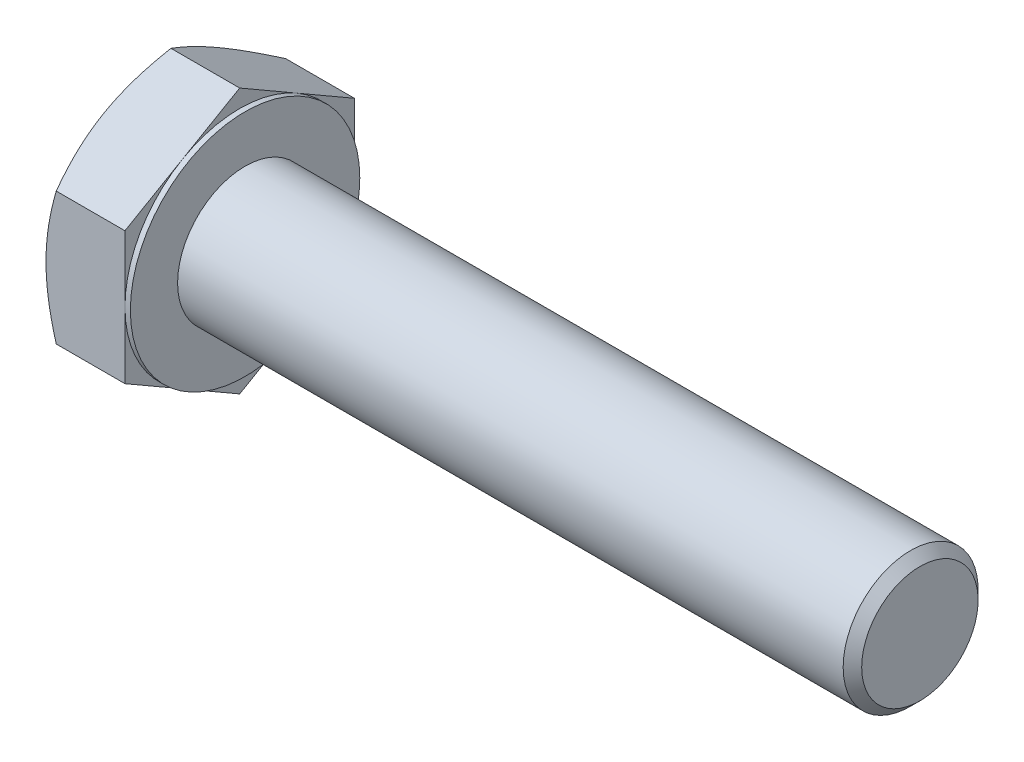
from build123d import *

# Parameters (mm, degrees)
BASEHEAD_DEPTH = 12.5
SKETCH4_W      = 0.8
SKETCH4_H      = 12.629909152


with BuildPart() as part:
    # Sketch1 → BaseHead (new body)
    with BuildSketch(Plane(origin=(0, 0, 0), x_dir=(0, 0, -1), z_dir=(1, 0, 0))):
        Polygon((17, 9.814954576), (17, -9.814954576), (0, -19.629909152), (-17, -9.814954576), (-17, 9.814954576), (0, 19.629909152), align=None)
    extrude(amount=BASEHEAD_DEPTH)

    # BodySke → BaseBody (revolve)
    with BuildSketch(Plane.XY, mode=Mode.PRIVATE) as basebody_sk:
        Polygon((0, 0), (112.5, 0), (112.5, 8.626), (111.126, 10), (0, 10), align=None)
    revolve(basebody_sk.sketch.rotate(Axis((0, 0, 0), (1, 0, 0)), 90), axis=Axis((0, 0, 0), (1, 0, 0)))

    # Sketch3 → HeadChamfer (revolve, cut)
    with BuildSketch(Plane.XY):
        Polygon((0, 17), (4.405130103, 24.629909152), (4.405130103, 29.629909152), (-10, 29.629909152), (-10, 17), align=None)
    revolve(axis=Axis((0, 0, 0), (1, 0, 0)), mode=Mode.SUBTRACT)

    # Sketch4 → BearingFace (revolve, cut)
    with BuildSketch(Plane.XY, mode=Mode.PRIVATE) as bearingface_sk:
        with Locations((12.1, 23.314954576)):
            Rectangle(SKETCH4_W, SKETCH4_H)
    revolve(bearingface_sk.sketch.rotate(Axis((0, 0, 0), (1, 0, 0)), 270), axis=Axis((0, 0, 0), (1, 0, 0)), mode=Mode.SUBTRACT)


solid = part.part
